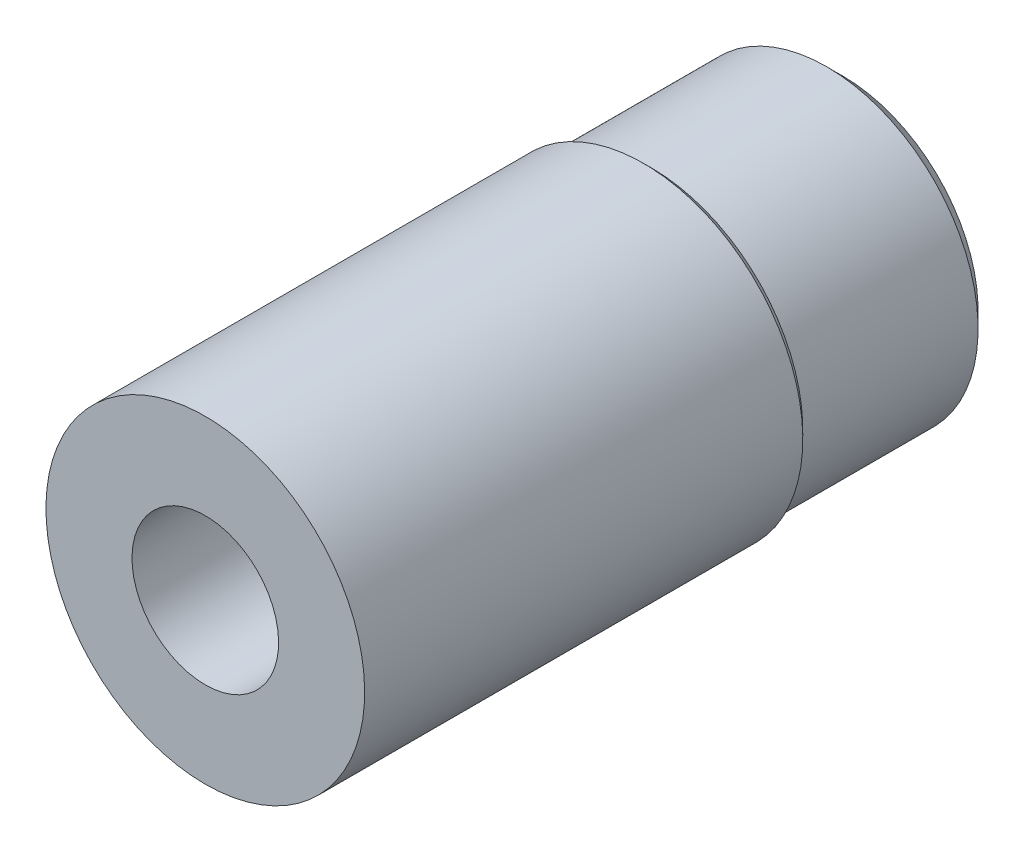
ISO-10303-21;
HEADER;
FILE_DESCRIPTION(('STEP AP214'),'2;1');
FILE_NAME('part.step','',(''),(''),'','','');
FILE_SCHEMA(('AUTOMOTIVE_DESIGN { 1 0 10303 214 1 1 1 1 }'));
ENDSEC;
DATA;
#1=APPLICATION_CONTEXT('core data for automotive mechanical design processes');
#2=APPLICATION_PROTOCOL_DEFINITION('international standard','automotive_design',2000,#1);
#3=PRODUCT_CONTEXT('',#1,'mechanical');
#4=PRODUCT('Part','Part','',(#3));
#5=PRODUCT_RELATED_PRODUCT_CATEGORY('part','',(#4));
#6=PRODUCT_DEFINITION_FORMATION('','',#4);
#7=PRODUCT_DEFINITION_CONTEXT('part definition',#1,'design');
#8=PRODUCT_DEFINITION('design','',#6,#7);
#9=PRODUCT_DEFINITION_SHAPE('','',#8);
#10=(LENGTH_UNIT() NAMED_UNIT(*) SI_UNIT(.MILLI.,.METRE.));
#11=(NAMED_UNIT(*) PLANE_ANGLE_UNIT() SI_UNIT($,.RADIAN.));
#12=(NAMED_UNIT(*) SI_UNIT($,.STERADIAN.) SOLID_ANGLE_UNIT());
#13=UNCERTAINTY_MEASURE_WITH_UNIT(LENGTH_MEASURE(1.E-05),#10,'distance_accuracy_value','');
#14=(GEOMETRIC_REPRESENTATION_CONTEXT(3) GLOBAL_UNCERTAINTY_ASSIGNED_CONTEXT((#13)) GLOBAL_UNIT_ASSIGNED_CONTEXT((#10,
#11,#12)) REPRESENTATION_CONTEXT('',''));
#15=CARTESIAN_POINT('',(0.,0.,0.));
#16=DIRECTION('',(0.,0.,1.));
#17=DIRECTION('',(1.,0.,0.));
#18=AXIS2_PLACEMENT_3D('',#15,#16,#17);
#19=CARTESIAN_POINT('',(1.5,0.,-14.));
#20=DIRECTION('',(0.,0.,-1.));
#21=DIRECTION('',(-1.,0.,0.));
#22=AXIS2_PLACEMENT_3D('',#19,#20,#21);
#23=PLANE('',#22);
#24=CARTESIAN_POINT('',(0.,0.,-14.));
#25=DIRECTION('',(0.,0.,1.));
#26=DIRECTION('',(0.,-1.,0.));
#27=AXIS2_PLACEMENT_3D('',#24,#25,#26);
#28=CIRCLE('',#27,1.25000000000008);
#29=CARTESIAN_POINT('',(0.,-1.25000000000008,-14.));
#30=VERTEX_POINT('',#29);
#31=EDGE_CURVE('E54',#30,#30,#28,.T.);
#32=ORIENTED_EDGE('',*,*,#31,.T.);
#33=EDGE_LOOP('',(#32));
#34=FACE_BOUND('',#33,.T.);
#35=CARTESIAN_POINT('',(0.,0.,-14.));
#36=DIRECTION('',(0.,0.,1.));
#37=DIRECTION('',(0.,-1.,0.));
#38=AXIS2_PLACEMENT_3D('',#35,#36,#37);
#39=CIRCLE('',#38,1.74999999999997);
#40=CARTESIAN_POINT('',(0.,-1.74999999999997,-14.));
#41=VERTEX_POINT('',#40);
#42=EDGE_CURVE('E17',#41,#41,#39,.F.);
#43=ORIENTED_EDGE('',*,*,#42,.T.);
#44=EDGE_LOOP('',(#43));
#45=FACE_BOUND('',#44,.T.);
#46=ADVANCED_FACE('F14',(#34,#45),#23,.T.);
#47=CARTESIAN_POINT('',(0.,0.,-20.));
#48=DIRECTION('',(0.,0.,1.));
#49=DIRECTION('',(0.,-1.,0.));
#50=AXIS2_PLACEMENT_3D('',#47,#48,#49);
#51=CYLINDRICAL_SURFACE('',#50,1.74999999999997);
#52=ORIENTED_EDGE('',*,*,#42,.F.);
#53=EDGE_LOOP('',(#52));
#54=FACE_BOUND('',#53,.T.);
#55=CARTESIAN_POINT('',(0.,0.,-20.));
#56=DIRECTION('',(0.,0.,1.));
#57=DIRECTION('',(0.,-1.,0.));
#58=AXIS2_PLACEMENT_3D('',#55,#56,#57);
#59=CIRCLE('',#58,1.74999999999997);
#60=CARTESIAN_POINT('',(0.,-1.74999999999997,-20.));
#61=VERTEX_POINT('',#60);
#62=EDGE_CURVE('E52',#61,#61,#59,.T.);
#63=ORIENTED_EDGE('',*,*,#62,.F.);
#64=EDGE_LOOP('',(#63));
#65=FACE_BOUND('',#64,.T.);
#66=ADVANCED_FACE('F62',(#54,#65),#51,.F.);
#67=CARTESIAN_POINT('',(0.,0.,-14.));
#68=DIRECTION('',(0.,0.,1.));
#69=DIRECTION('',(0.,-1.,0.));
#70=AXIS2_PLACEMENT_3D('',#67,#68,#69);
#71=CYLINDRICAL_SURFACE('',#70,1.25000000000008);
#72=CARTESIAN_POINT('',(0.,0.,-10.8870967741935));
#73=DIRECTION('',(0.,0.,1.));
#74=DIRECTION('',(0.,-1.,0.));
#75=AXIS2_PLACEMENT_3D('',#72,#73,#74);
#76=CIRCLE('',#75,1.25000000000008);
#77=CARTESIAN_POINT('',(0.,-1.25000000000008,-10.8870967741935));
#78=VERTEX_POINT('',#77);
#79=EDGE_CURVE('E49',#78,#78,#76,.F.);
#80=ORIENTED_EDGE('',*,*,#79,.F.);
#81=EDGE_LOOP('',(#80));
#82=FACE_BOUND('',#81,.T.);
#83=ORIENTED_EDGE('',*,*,#31,.F.);
#84=EDGE_LOOP('',(#83));
#85=FACE_BOUND('',#84,.T.);
#86=ADVANCED_FACE('F65',(#82,#85),#71,.F.);
#87=CARTESIAN_POINT('',(2.99999999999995,0.,-20.));
#88=DIRECTION('',(0.,0.,-1.));
#89=DIRECTION('',(-1.,0.,0.));
#90=AXIS2_PLACEMENT_3D('',#87,#88,#89);
#91=PLANE('',#90);
#92=ORIENTED_EDGE('',*,*,#62,.T.);
#93=EDGE_LOOP('',(#92));
#94=FACE_BOUND('',#93,.T.);
#95=CARTESIAN_POINT('',(0.,0.,-20.0000008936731));
#96=DIRECTION('',(0.,0.,1.));
#97=DIRECTION('',(0.,-1.,0.));
#98=AXIS2_PLACEMENT_3D('',#95,#96,#97);
#99=CIRCLE('',#98,4.25000089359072);
#100=CARTESIAN_POINT('',(0.,-4.25000089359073,-20.0000008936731));
#101=VERTEX_POINT('',#100);
#102=EDGE_CURVE('E46',#101,#101,#99,.T.);
#103=ORIENTED_EDGE('',*,*,#102,.F.);
#104=EDGE_LOOP('',(#103));
#105=FACE_BOUND('',#104,.T.);
#106=ADVANCED_FACE('F68',(#94,#105),#91,.T.);
#107=CARTESIAN_POINT('',(1.77500000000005,0.,-10.8870967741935));
#108=DIRECTION('',(0.,0.,1.));
#109=DIRECTION('',(1.,0.,0.));
#110=AXIS2_PLACEMENT_3D('',#107,#108,#109);
#111=PLANE('',#110);
#112=ORIENTED_EDGE('',*,*,#79,.T.);
#113=EDGE_LOOP('',(#112));
#114=FACE_BOUND('',#113,.T.);
#115=CARTESIAN_POINT('',(0.,0.,-10.8870967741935));
#116=DIRECTION('',(0.,0.,1.));
#117=DIRECTION('',(0.,-1.,0.));
#118=AXIS2_PLACEMENT_3D('',#115,#116,#117);
#119=CIRCLE('',#118,2.3);
#120=CARTESIAN_POINT('',(0.,-2.3,-10.8870967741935));
#121=VERTEX_POINT('',#120);
#122=EDGE_CURVE('E39',#121,#121,#119,.T.);
#123=ORIENTED_EDGE('',*,*,#122,.T.);
#124=EDGE_LOOP('',(#123));
#125=FACE_BOUND('',#124,.T.);
#126=ADVANCED_FACE('F71',(#114,#125),#111,.T.);
#127=CARTESIAN_POINT('',(0.,0.,-19.5000008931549));
#128=DIRECTION('',(0.,0.,1.));
#129=DIRECTION('',(0.,-1.,0.));
#130=AXIS2_PLACEMENT_3D('',#127,#128,#129);
#131=CONICAL_SURFACE('',#130,4.75000089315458,0.785398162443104);
#132=ORIENTED_EDGE('',*,*,#102,.T.);
#133=EDGE_LOOP('',(#132));
#134=FACE_BOUND('',#133,.T.);
#135=CARTESIAN_POINT('',(0.,0.,-19.5));
#136=DIRECTION('',(0.,0.,1.));
#137=DIRECTION('',(0.,-1.,0.));
#138=AXIS2_PLACEMENT_3D('',#135,#136,#137);
#139=CIRCLE('',#138,4.75);
#140=CARTESIAN_POINT('',(0.,-4.75,-19.5));
#141=VERTEX_POINT('',#140);
#142=EDGE_CURVE('E36',#141,#141,#139,.T.);
#143=ORIENTED_EDGE('',*,*,#142,.F.);
#144=EDGE_LOOP('',(#143));
#145=FACE_BOUND('',#144,.T.);
#146=ADVANCED_FACE('F75',(#134,#145),#131,.T.);
#147=CARTESIAN_POINT('',(0.,0.,-10.8870967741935));
#148=DIRECTION('',(0.,0.,1.));
#149=DIRECTION('',(0.,-1.,0.));
#150=AXIS2_PLACEMENT_3D('',#147,#148,#149);
#151=CYLINDRICAL_SURFACE('',#150,2.3);
#152=CARTESIAN_POINT('',(0.,0.,0.));
#153=DIRECTION('',(0.,0.,1.));
#154=DIRECTION('',(0.,-1.,0.));
#155=AXIS2_PLACEMENT_3D('',#152,#153,#154);
#156=CIRCLE('',#155,2.3);
#157=CARTESIAN_POINT('',(0.,-2.3,0.));
#158=VERTEX_POINT('',#157);
#159=EDGE_CURVE('E33',#158,#158,#156,.F.);
#160=ORIENTED_EDGE('',*,*,#159,.F.);
#161=EDGE_LOOP('',(#160));
#162=FACE_BOUND('',#161,.T.);
#163=ORIENTED_EDGE('',*,*,#122,.F.);
#164=EDGE_LOOP('',(#163));
#165=FACE_BOUND('',#164,.T.);
#166=ADVANCED_FACE('F78',(#162,#165),#151,.F.);
#167=CARTESIAN_POINT('',(0.,0.,-19.5));
#168=DIRECTION('',(0.,0.,1.));
#169=DIRECTION('',(0.,-1.,0.));
#170=AXIS2_PLACEMENT_3D('',#167,#168,#169);
#171=CYLINDRICAL_SURFACE('',#170,4.75);
#172=ORIENTED_EDGE('',*,*,#142,.T.);
#173=EDGE_LOOP('',(#172));
#174=FACE_BOUND('',#173,.T.);
#175=CARTESIAN_POINT('',(0.,0.,-14.0000008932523));
#176=DIRECTION('',(0.,0.,1.));
#177=DIRECTION('',(0.,-1.,0.));
#178=AXIS2_PLACEMENT_3D('',#175,#176,#177);
#179=CIRCLE('',#178,4.75000089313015);
#180=CARTESIAN_POINT('',(0.,-4.75000089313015,-14.0000008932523));
#181=VERTEX_POINT('',#180);
#182=EDGE_CURVE('E26',#181,#181,#179,.T.);
#183=ORIENTED_EDGE('',*,*,#182,.F.);
#184=EDGE_LOOP('',(#183));
#185=FACE_BOUND('',#184,.T.);
#186=ADVANCED_FACE('F82',(#174,#185),#171,.T.);
#187=CARTESIAN_POINT('',(3.79999999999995,0.,0.));
#188=DIRECTION('',(0.,0.,1.));
#189=DIRECTION('',(1.,0.,0.));
#190=AXIS2_PLACEMENT_3D('',#187,#188,#189);
#191=PLANE('',#190);
#192=CARTESIAN_POINT('',(0.,0.,0.));
#193=DIRECTION('',(0.,0.,1.));
#194=DIRECTION('',(0.,-1.,0.));
#195=AXIS2_PLACEMENT_3D('',#192,#193,#194);
#196=CIRCLE('',#195,5.);
#197=CARTESIAN_POINT('',(0.,-5.,0.));
#198=VERTEX_POINT('',#197);
#199=EDGE_CURVE('E21',#198,#198,#196,.F.);
#200=ORIENTED_EDGE('',*,*,#199,.F.);
#201=EDGE_LOOP('',(#200));
#202=FACE_BOUND('',#201,.T.);
#203=ORIENTED_EDGE('',*,*,#159,.T.);
#204=EDGE_LOOP('',(#203));
#205=FACE_BOUND('',#204,.T.);
#206=ADVANCED_FACE('F85',(#202,#205),#191,.T.);
#207=CARTESIAN_POINT('',(0.,0.,-13.750000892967));
#208=DIRECTION('',(0.,0.,1.));
#209=DIRECTION('',(0.,-1.,0.));
#210=AXIS2_PLACEMENT_3D('',#207,#208,#209);
#211=CONICAL_SURFACE('',#210,5.0000008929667,0.785398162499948);
#212=ORIENTED_EDGE('',*,*,#182,.T.);
#213=EDGE_LOOP('',(#212));
#214=FACE_BOUND('',#213,.T.);
#215=CARTESIAN_POINT('',(0.,0.,-13.75));
#216=DIRECTION('',(0.,0.,1.));
#217=DIRECTION('',(0.,-1.,0.));
#218=AXIS2_PLACEMENT_3D('',#215,#216,#217);
#219=CIRCLE('',#218,5.);
#220=CARTESIAN_POINT('',(0.,-5.,-13.75));
#221=VERTEX_POINT('',#220);
#222=EDGE_CURVE('E9',#221,#221,#219,.T.);
#223=ORIENTED_EDGE('',*,*,#222,.F.);
#224=EDGE_LOOP('',(#223));
#225=FACE_BOUND('',#224,.T.);
#226=ADVANCED_FACE('F89',(#214,#225),#211,.T.);
#227=CARTESIAN_POINT('',(0.,0.,-13.75));
#228=DIRECTION('',(0.,0.,1.));
#229=DIRECTION('',(0.,-1.,0.));
#230=AXIS2_PLACEMENT_3D('',#227,#228,#229);
#231=CYLINDRICAL_SURFACE('',#230,5.);
#232=ORIENTED_EDGE('',*,*,#222,.T.);
#233=EDGE_LOOP('',(#232));
#234=FACE_BOUND('',#233,.T.);
#235=ORIENTED_EDGE('',*,*,#199,.T.);
#236=EDGE_LOOP('',(#235));
#237=FACE_BOUND('',#236,.T.);
#238=ADVANCED_FACE('F92',(#234,#237),#231,.T.);
#239=CLOSED_SHELL('',(#46,#66,#86,#106,#126,#146,#166,#186,#206,#226,#238));
#240=MANIFOLD_SOLID_BREP('B1',#239);
#241=ADVANCED_BREP_SHAPE_REPRESENTATION('',(#18,#240),#14);
#242=SHAPE_DEFINITION_REPRESENTATION(#9,#241);
ENDSEC;
END-ISO-10303-21;
